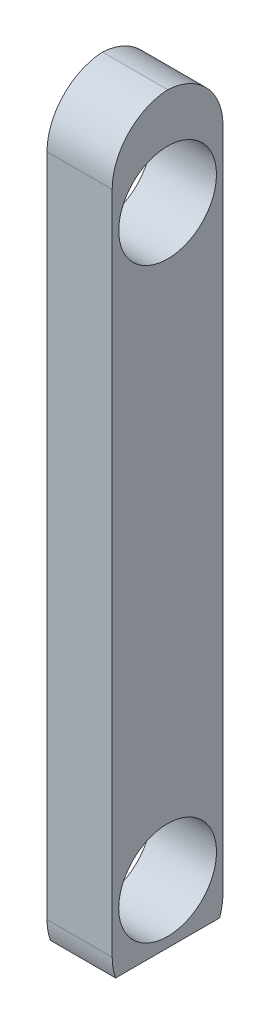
ISO-10303-21;
HEADER;
FILE_DESCRIPTION(('STEP AP214'),'2;1');
FILE_NAME('part.step','',(''),(''),'','','');
FILE_SCHEMA(('AUTOMOTIVE_DESIGN { 1 0 10303 214 1 1 1 1 }'));
ENDSEC;
DATA;
#1=APPLICATION_CONTEXT('core data for automotive mechanical design processes');
#2=APPLICATION_PROTOCOL_DEFINITION('international standard','automotive_design',2000,#1);
#3=PRODUCT_CONTEXT('',#1,'mechanical');
#4=PRODUCT('Part','Part','',(#3));
#5=PRODUCT_RELATED_PRODUCT_CATEGORY('part','',(#4));
#6=PRODUCT_DEFINITION_FORMATION('','',#4);
#7=PRODUCT_DEFINITION_CONTEXT('part definition',#1,'design');
#8=PRODUCT_DEFINITION('design','',#6,#7);
#9=PRODUCT_DEFINITION_SHAPE('','',#8);
#10=(LENGTH_UNIT() NAMED_UNIT(*) SI_UNIT(.MILLI.,.METRE.));
#11=(NAMED_UNIT(*) PLANE_ANGLE_UNIT() SI_UNIT($,.RADIAN.));
#12=(NAMED_UNIT(*) SI_UNIT($,.STERADIAN.) SOLID_ANGLE_UNIT());
#13=UNCERTAINTY_MEASURE_WITH_UNIT(LENGTH_MEASURE(1.E-05),#10,'distance_accuracy_value','');
#14=(GEOMETRIC_REPRESENTATION_CONTEXT(3) GLOBAL_UNCERTAINTY_ASSIGNED_CONTEXT((#13)) GLOBAL_UNIT_ASSIGNED_CONTEXT((#10,
#11,#12)) REPRESENTATION_CONTEXT('',''));
#15=CARTESIAN_POINT('',(0.,0.,0.));
#16=DIRECTION('',(0.,0.,1.));
#17=DIRECTION('',(1.,0.,0.));
#18=AXIS2_PLACEMENT_3D('',#15,#16,#17);
#19=CARTESIAN_POINT('',(2.,0.,-7.10219321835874));
#20=DIRECTION('',(0.,0.,1.));
#21=DIRECTION('',(0.,-1.,0.));
#22=AXIS2_PLACEMENT_3D('',#19,#20,#21);
#23=PLANE('',#22);
#24=DIRECTION('',(0.,1.,0.));
#25=VECTOR('',#24,1.);
#26=CARTESIAN_POINT('',(2.,0.,-7.10219321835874));
#27=LINE('',#26,#25);
#28=CARTESIAN_POINT('',(2.,-22.2,-7.10219321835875));
#29=VERTEX_POINT('',#28);
#30=CARTESIAN_POINT('',(2.,-1.8,-7.10219321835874));
#31=VERTEX_POINT('',#30);
#32=EDGE_CURVE('E166',#29,#31,#27,.T.);
#33=ORIENTED_EDGE('',*,*,#32,.F.);
#34=DIRECTION('',(-1.,0.,0.));
#35=VECTOR('',#34,1.);
#36=CARTESIAN_POINT('',(2.,-22.2,-7.10219321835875));
#37=LINE('',#36,#35);
#38=CARTESIAN_POINT('',(0.,-22.2,-7.10219321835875));
#39=VERTEX_POINT('',#38);
#40=EDGE_CURVE('E180',#29,#39,#37,.T.);
#41=ORIENTED_EDGE('',*,*,#40,.T.);
#42=DIRECTION('',(0.,1.,0.));
#43=VECTOR('',#42,1.);
#44=CARTESIAN_POINT('',(0.,0.,-7.10219321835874));
#45=LINE('',#44,#43);
#46=CARTESIAN_POINT('',(0.,-1.8,-7.10219321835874));
#47=VERTEX_POINT('',#46);
#48=EDGE_CURVE('E167',#39,#47,#45,.T.);
#49=ORIENTED_EDGE('',*,*,#48,.T.);
#50=DIRECTION('',(-1.,0.,0.));
#51=VECTOR('',#50,1.);
#52=CARTESIAN_POINT('',(2.,-1.8,-7.10219321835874));
#53=LINE('',#52,#51);
#54=EDGE_CURVE('E177',#47,#31,#53,.F.);
#55=ORIENTED_EDGE('',*,*,#54,.T.);
#56=EDGE_LOOP('',(#33,#41,#49,#55));
#57=FACE_BOUND('',#56,.T.);
#58=ADVANCED_FACE('F49',(#57),#23,.F.);
#59=CARTESIAN_POINT('',(2.,-24.,-3.70219321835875));
#60=DIRECTION('',(0.,0.,-1.));
#61=DIRECTION('',(-1.,0.,0.));
#62=AXIS2_PLACEMENT_3D('',#59,#60,#61);
#63=PLANE('',#62);
#64=DIRECTION('',(0.,-1.,0.));
#65=VECTOR('',#64,1.);
#66=CARTESIAN_POINT('',(0.,-24.,-3.70219321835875));
#67=LINE('',#66,#65);
#68=CARTESIAN_POINT('',(0.,-1.8,-3.70219321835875));
#69=VERTEX_POINT('',#68);
#70=CARTESIAN_POINT('',(0.,-22.2,-3.70219321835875));
#71=VERTEX_POINT('',#70);
#72=EDGE_CURVE('E159',#69,#71,#67,.T.);
#73=ORIENTED_EDGE('',*,*,#72,.T.);
#74=DIRECTION('',(-1.,0.,0.));
#75=VECTOR('',#74,1.);
#76=CARTESIAN_POINT('',(2.,-22.2,-3.70219321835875));
#77=LINE('',#76,#75);
#78=CARTESIAN_POINT('',(2.,-22.2,-3.70219321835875));
#79=VERTEX_POINT('',#78);
#80=EDGE_CURVE('E11',#71,#79,#77,.F.);
#81=ORIENTED_EDGE('',*,*,#80,.T.);
#82=DIRECTION('',(0.,-1.,0.));
#83=VECTOR('',#82,1.);
#84=CARTESIAN_POINT('',(2.,-24.,-3.70219321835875));
#85=LINE('',#84,#83);
#86=CARTESIAN_POINT('',(2.,-1.8,-3.70219321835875));
#87=VERTEX_POINT('',#86);
#88=EDGE_CURVE('E161',#87,#79,#85,.T.);
#89=ORIENTED_EDGE('',*,*,#88,.F.);
#90=DIRECTION('',(-1.,0.,0.));
#91=VECTOR('',#90,1.);
#92=CARTESIAN_POINT('',(2.,-1.8,-3.70219321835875));
#93=LINE('',#92,#91);
#94=EDGE_CURVE('E59',#87,#69,#93,.T.);
#95=ORIENTED_EDGE('',*,*,#94,.T.);
#96=EDGE_LOOP('',(#73,#81,#89,#95));
#97=FACE_BOUND('',#96,.T.);
#98=ADVANCED_FACE('F158',(#97),#63,.F.);
#99=CARTESIAN_POINT('',(2.,0.,0.));
#100=DIRECTION('',(-1.,0.,0.));
#101=DIRECTION('',(0.,0.,1.));
#102=AXIS2_PLACEMENT_3D('',#99,#100,#101);
#103=PLANE('',#102);
#104=CARTESIAN_POINT('',(2.,-3.,-5.40219321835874));
#105=DIRECTION('',(1.,0.,0.));
#106=DIRECTION('',(0.,0.,-1.));
#107=AXIS2_PLACEMENT_3D('',#104,#105,#106);
#108=CIRCLE('',#107,1.5);
#109=CARTESIAN_POINT('',(2.,-3.,-6.90219321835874));
#110=VERTEX_POINT('',#109);
#111=EDGE_CURVE('E203',#110,#110,#108,.T.);
#112=ORIENTED_EDGE('',*,*,#111,.F.);
#113=EDGE_LOOP('',(#112));
#114=FACE_BOUND('',#113,.T.);
#115=CARTESIAN_POINT('',(2.,-21.,-5.40219321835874));
#116=DIRECTION('',(1.,0.,0.));
#117=DIRECTION('',(0.,0.,1.));
#118=AXIS2_PLACEMENT_3D('',#115,#116,#117);
#119=CIRCLE('',#118,1.5);
#120=CARTESIAN_POINT('',(2.,-21.,-3.90219321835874));
#121=VERTEX_POINT('',#120);
#122=EDGE_CURVE('E199',#121,#121,#119,.T.);
#123=ORIENTED_EDGE('',*,*,#122,.F.);
#124=EDGE_LOOP('',(#123));
#125=FACE_BOUND('',#124,.T.);
#126=CARTESIAN_POINT('',(2.,-22.2,-5.50219321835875));
#127=DIRECTION('',(-1.,0.,0.));
#128=DIRECTION('',(0.,0.,1.));
#129=AXIS2_PLACEMENT_3D('',#126,#127,#128);
#130=CIRCLE('',#129,1.8);
#131=CARTESIAN_POINT('',(2.,-22.8047714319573,-3.80683145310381));
#132=VERTEX_POINT('',#131);
#133=EDGE_CURVE('E147',#79,#132,#130,.F.);
#134=ORIENTED_EDGE('',*,*,#133,.T.);
#135=DIRECTION('',(0.,0.,1.));
#136=VECTOR('',#135,1.);
#137=CARTESIAN_POINT('',(2.,-22.8047714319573,-3.80683145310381));
#138=LINE('',#137,#136);
#139=CARTESIAN_POINT('',(2.,-22.8047714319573,-6.99755498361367));
#140=VERTEX_POINT('',#139);
#141=EDGE_CURVE('E111',#140,#132,#138,.T.);
#142=ORIENTED_EDGE('',*,*,#141,.F.);
#143=CARTESIAN_POINT('',(2.,-22.2,-5.30219321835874));
#144=DIRECTION('',(-1.,0.,0.));
#145=DIRECTION('',(0.,0.,1.));
#146=AXIS2_PLACEMENT_3D('',#143,#144,#145);
#147=CIRCLE('',#146,1.8);
#148=EDGE_CURVE('E150',#140,#29,#147,.F.);
#149=ORIENTED_EDGE('',*,*,#148,.T.);
#150=ORIENTED_EDGE('',*,*,#32,.T.);
#151=CARTESIAN_POINT('',(2.,-1.8,-5.30219321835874));
#152=DIRECTION('',(-1.,0.,0.));
#153=DIRECTION('',(0.,0.,1.));
#154=AXIS2_PLACEMENT_3D('',#151,#152,#153);
#155=CIRCLE('',#154,1.8);
#156=CARTESIAN_POINT('',(2.,-0.00277992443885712,-5.40219321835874));
#157=VERTEX_POINT('',#156);
#158=EDGE_CURVE('E74',#31,#157,#155,.F.);
#159=ORIENTED_EDGE('',*,*,#158,.T.);
#160=CARTESIAN_POINT('',(2.,-1.8,-5.50219321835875));
#161=DIRECTION('',(-1.,0.,0.));
#162=DIRECTION('',(0.,0.,1.));
#163=AXIS2_PLACEMENT_3D('',#160,#161,#162);
#164=CIRCLE('',#163,1.8);
#165=EDGE_CURVE('E144',#157,#87,#164,.F.);
#166=ORIENTED_EDGE('',*,*,#165,.T.);
#167=ORIENTED_EDGE('',*,*,#88,.T.);
#168=EDGE_LOOP('',(#134,#142,#149,#150,#159,#166,#167));
#169=FACE_BOUND('',#168,.T.);
#170=ADVANCED_FACE('F193',(#114,#125,#169),#103,.F.);
#171=CARTESIAN_POINT('',(0.,0.,0.));
#172=DIRECTION('',(-1.,0.,0.));
#173=DIRECTION('',(0.,0.,1.));
#174=AXIS2_PLACEMENT_3D('',#171,#172,#173);
#175=PLANE('',#174);
#176=DIRECTION('',(0.,0.,1.));
#177=VECTOR('',#176,1.);
#178=CARTESIAN_POINT('',(0.,-22.8047714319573,-3.80683145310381));
#179=LINE('',#178,#177);
#180=CARTESIAN_POINT('',(0.,-22.8047714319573,-6.99755498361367));
#181=VERTEX_POINT('',#180);
#182=CARTESIAN_POINT('',(0.,-22.8047714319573,-3.80683145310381));
#183=VERTEX_POINT('',#182);
#184=EDGE_CURVE('E66',#181,#183,#179,.T.);
#185=ORIENTED_EDGE('',*,*,#184,.T.);
#186=CARTESIAN_POINT('',(0.,-22.2,-5.50219321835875));
#187=DIRECTION('',(-1.,0.,0.));
#188=DIRECTION('',(0.,0.,1.));
#189=AXIS2_PLACEMENT_3D('',#186,#187,#188);
#190=CIRCLE('',#189,1.8);
#191=EDGE_CURVE('E124',#183,#71,#190,.T.);
#192=ORIENTED_EDGE('',*,*,#191,.T.);
#193=ORIENTED_EDGE('',*,*,#72,.F.);
#194=CARTESIAN_POINT('',(0.,-1.8,-5.50219321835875));
#195=DIRECTION('',(-1.,0.,0.));
#196=DIRECTION('',(0.,0.,1.));
#197=AXIS2_PLACEMENT_3D('',#194,#195,#196);
#198=CIRCLE('',#197,1.8);
#199=CARTESIAN_POINT('',(0.,-0.00277992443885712,-5.40219321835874));
#200=VERTEX_POINT('',#199);
#201=EDGE_CURVE('E133',#69,#200,#198,.T.);
#202=ORIENTED_EDGE('',*,*,#201,.T.);
#203=CARTESIAN_POINT('',(0.,-1.8,-5.30219321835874));
#204=DIRECTION('',(-1.,0.,0.));
#205=DIRECTION('',(0.,0.,1.));
#206=AXIS2_PLACEMENT_3D('',#203,#204,#205);
#207=CIRCLE('',#206,1.8);
#208=EDGE_CURVE('E138',#200,#47,#207,.T.);
#209=ORIENTED_EDGE('',*,*,#208,.T.);
#210=ORIENTED_EDGE('',*,*,#48,.F.);
#211=CARTESIAN_POINT('',(0.,-22.2,-5.30219321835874));
#212=DIRECTION('',(-1.,0.,0.));
#213=DIRECTION('',(0.,0.,1.));
#214=AXIS2_PLACEMENT_3D('',#211,#212,#213);
#215=CIRCLE('',#214,1.8);
#216=EDGE_CURVE('E127',#39,#181,#215,.T.);
#217=ORIENTED_EDGE('',*,*,#216,.T.);
#218=EDGE_LOOP('',(#185,#192,#193,#202,#209,#210,#217));
#219=FACE_BOUND('',#218,.T.);
#220=CARTESIAN_POINT('',(0.,-3.,-5.40219321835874));
#221=DIRECTION('',(1.,0.,0.));
#222=DIRECTION('',(0.,0.,-1.));
#223=AXIS2_PLACEMENT_3D('',#220,#221,#222);
#224=CIRCLE('',#223,1.5);
#225=CARTESIAN_POINT('',(0.,-3.,-6.90219321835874));
#226=VERTEX_POINT('',#225);
#227=EDGE_CURVE('E173',#226,#226,#224,.T.);
#228=ORIENTED_EDGE('',*,*,#227,.T.);
#229=EDGE_LOOP('',(#228));
#230=FACE_BOUND('',#229,.T.);
#231=CARTESIAN_POINT('',(0.,-21.,-5.40219321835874));
#232=DIRECTION('',(1.,0.,0.));
#233=DIRECTION('',(0.,0.,1.));
#234=AXIS2_PLACEMENT_3D('',#231,#232,#233);
#235=CIRCLE('',#234,1.5);
#236=CARTESIAN_POINT('',(0.,-21.,-3.90219321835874));
#237=VERTEX_POINT('',#236);
#238=EDGE_CURVE('E191',#237,#237,#235,.T.);
#239=ORIENTED_EDGE('',*,*,#238,.T.);
#240=EDGE_LOOP('',(#239));
#241=FACE_BOUND('',#240,.T.);
#242=ADVANCED_FACE('F121',(#219,#230,#241),#175,.T.);
#243=CARTESIAN_POINT('',(0.,-21.,-5.40219321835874));
#244=DIRECTION('',(1.,0.,0.));
#245=DIRECTION('',(0.,0.,-1.));
#246=AXIS2_PLACEMENT_3D('',#243,#244,#245);
#247=CYLINDRICAL_SURFACE('',#246,1.5);
#248=ORIENTED_EDGE('',*,*,#238,.F.);
#249=EDGE_LOOP('',(#248));
#250=FACE_BOUND('',#249,.T.);
#251=ORIENTED_EDGE('',*,*,#122,.T.);
#252=EDGE_LOOP('',(#251));
#253=FACE_BOUND('',#252,.T.);
#254=ADVANCED_FACE('F235',(#250,#253),#247,.F.);
#255=CARTESIAN_POINT('',(0.,-3.,-5.40219321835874));
#256=DIRECTION('',(1.,0.,0.));
#257=DIRECTION('',(0.,0.,-1.));
#258=AXIS2_PLACEMENT_3D('',#255,#256,#257);
#259=CYLINDRICAL_SURFACE('',#258,1.5);
#260=ORIENTED_EDGE('',*,*,#227,.F.);
#261=EDGE_LOOP('',(#260));
#262=FACE_BOUND('',#261,.T.);
#263=ORIENTED_EDGE('',*,*,#111,.T.);
#264=EDGE_LOOP('',(#263));
#265=FACE_BOUND('',#264,.T.);
#266=ADVANCED_FACE('F223',(#262,#265),#259,.F.);
#267=CARTESIAN_POINT('',(2.,-22.2,-5.50219321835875));
#268=DIRECTION('',(-1.,0.,0.));
#269=DIRECTION('',(0.,0.,1.));
#270=AXIS2_PLACEMENT_3D('',#267,#268,#269);
#271=CYLINDRICAL_SURFACE('',#270,1.8);
#272=DIRECTION('',(1.,0.,0.));
#273=VECTOR('',#272,1.);
#274=CARTESIAN_POINT('',(0.,-22.8047714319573,-3.80683145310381));
#275=LINE('',#274,#273);
#276=EDGE_CURVE('E108',#183,#132,#275,.T.);
#277=ORIENTED_EDGE('',*,*,#276,.T.);
#278=ORIENTED_EDGE('',*,*,#133,.F.);
#279=ORIENTED_EDGE('',*,*,#80,.F.);
#280=ORIENTED_EDGE('',*,*,#191,.F.);
#281=EDGE_LOOP('',(#277,#278,#279,#280));
#282=FACE_BOUND('',#281,.T.);
#283=ADVANCED_FACE('F131',(#282),#271,.T.);
#284=CARTESIAN_POINT('',(2.,-22.2,-5.30219321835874));
#285=DIRECTION('',(-1.,0.,0.));
#286=DIRECTION('',(0.,0.,1.));
#287=AXIS2_PLACEMENT_3D('',#284,#285,#286);
#288=CYLINDRICAL_SURFACE('',#287,1.8);
#289=DIRECTION('',(1.,0.,0.));
#290=VECTOR('',#289,1.);
#291=CARTESIAN_POINT('',(0.,-22.8047714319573,-6.99755498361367));
#292=LINE('',#291,#290);
#293=EDGE_CURVE('E117',#181,#140,#292,.T.);
#294=ORIENTED_EDGE('',*,*,#293,.F.);
#295=ORIENTED_EDGE('',*,*,#216,.F.);
#296=ORIENTED_EDGE('',*,*,#40,.F.);
#297=ORIENTED_EDGE('',*,*,#148,.F.);
#298=EDGE_LOOP('',(#294,#295,#296,#297));
#299=FACE_BOUND('',#298,.T.);
#300=ADVANCED_FACE('F215',(#299),#288,.T.);
#301=CARTESIAN_POINT('',(2.,-1.8,-5.30219321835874));
#302=DIRECTION('',(-1.,0.,0.));
#303=DIRECTION('',(0.,0.,1.));
#304=AXIS2_PLACEMENT_3D('',#301,#302,#303);
#305=CYLINDRICAL_SURFACE('',#304,1.8);
#306=DIRECTION('',(-1.,0.,0.));
#307=VECTOR('',#306,1.);
#308=CARTESIAN_POINT('',(1.,-0.00277992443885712,-5.40219321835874));
#309=LINE('',#308,#307);
#310=EDGE_CURVE('E53',#157,#200,#309,.T.);
#311=ORIENTED_EDGE('',*,*,#310,.F.);
#312=ORIENTED_EDGE('',*,*,#158,.F.);
#313=ORIENTED_EDGE('',*,*,#54,.F.);
#314=ORIENTED_EDGE('',*,*,#208,.F.);
#315=EDGE_LOOP('',(#311,#312,#313,#314));
#316=FACE_BOUND('',#315,.T.);
#317=ADVANCED_FACE('F51',(#316),#305,.T.);
#318=CARTESIAN_POINT('',(2.,-1.8,-5.50219321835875));
#319=DIRECTION('',(-1.,0.,0.));
#320=DIRECTION('',(0.,0.,1.));
#321=AXIS2_PLACEMENT_3D('',#318,#319,#320);
#322=CYLINDRICAL_SURFACE('',#321,1.8);
#323=ORIENTED_EDGE('',*,*,#165,.F.);
#324=ORIENTED_EDGE('',*,*,#310,.T.);
#325=ORIENTED_EDGE('',*,*,#201,.F.);
#326=ORIENTED_EDGE('',*,*,#94,.F.);
#327=EDGE_LOOP('',(#323,#324,#325,#326));
#328=FACE_BOUND('',#327,.T.);
#329=ADVANCED_FACE('F192',(#328),#322,.T.);
#330=CARTESIAN_POINT('',(0.,-22.8047714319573,-3.80683145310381));
#331=DIRECTION('',(0.,1.,0.));
#332=DIRECTION('',(0.,0.,1.));
#333=AXIS2_PLACEMENT_3D('',#330,#331,#332);
#334=PLANE('',#333);
#335=ORIENTED_EDGE('',*,*,#141,.T.);
#336=ORIENTED_EDGE('',*,*,#276,.F.);
#337=ORIENTED_EDGE('',*,*,#184,.F.);
#338=ORIENTED_EDGE('',*,*,#293,.T.);
#339=EDGE_LOOP('',(#335,#336,#337,#338));
#340=FACE_BOUND('',#339,.T.);
#341=ADVANCED_FACE('F109',(#340),#334,.F.);
#342=CLOSED_SHELL('',(#58,#98,#170,#242,#254,#266,#283,#300,#317,#329,#341));
#343=MANIFOLD_SOLID_BREP('B2',#342);
#344=ADVANCED_BREP_SHAPE_REPRESENTATION('',(#18,#343),#14);
#345=SHAPE_DEFINITION_REPRESENTATION(#9,#344);
ENDSEC;
END-ISO-10303-21;
